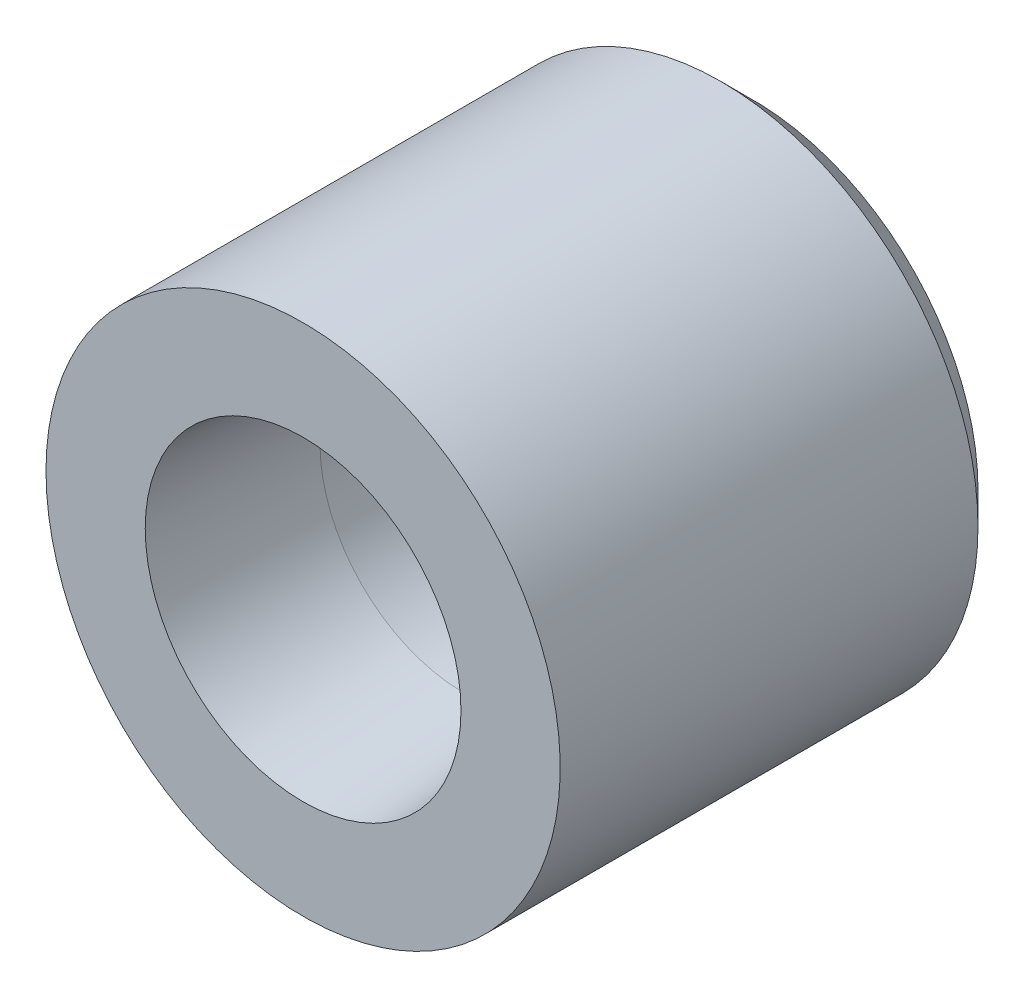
ISO-10303-21;
HEADER;
FILE_DESCRIPTION(('STEP AP214'),'2;1');
FILE_NAME('part.step','',(''),(''),'','','');
FILE_SCHEMA(('AUTOMOTIVE_DESIGN { 1 0 10303 214 1 1 1 1 }'));
ENDSEC;
DATA;
#1=APPLICATION_CONTEXT('core data for automotive mechanical design processes');
#2=APPLICATION_PROTOCOL_DEFINITION('international standard','automotive_design',2000,#1);
#3=PRODUCT_CONTEXT('',#1,'mechanical');
#4=PRODUCT('Part','Part','',(#3));
#5=PRODUCT_RELATED_PRODUCT_CATEGORY('part','',(#4));
#6=PRODUCT_DEFINITION_FORMATION('','',#4);
#7=PRODUCT_DEFINITION_CONTEXT('part definition',#1,'design');
#8=PRODUCT_DEFINITION('design','',#6,#7);
#9=PRODUCT_DEFINITION_SHAPE('','',#8);
#10=(LENGTH_UNIT() NAMED_UNIT(*) SI_UNIT(.MILLI.,.METRE.));
#11=(NAMED_UNIT(*) PLANE_ANGLE_UNIT() SI_UNIT($,.RADIAN.));
#12=(NAMED_UNIT(*) SI_UNIT($,.STERADIAN.) SOLID_ANGLE_UNIT());
#13=UNCERTAINTY_MEASURE_WITH_UNIT(LENGTH_MEASURE(1.E-05),#10,'distance_accuracy_value','');
#14=(GEOMETRIC_REPRESENTATION_CONTEXT(3) GLOBAL_UNCERTAINTY_ASSIGNED_CONTEXT((#13)) GLOBAL_UNIT_ASSIGNED_CONTEXT((#10,
#11,#12)) REPRESENTATION_CONTEXT('',''));
#15=CARTESIAN_POINT('',(0.,0.,0.));
#16=DIRECTION('',(0.,0.,1.));
#17=DIRECTION('',(1.,0.,0.));
#18=AXIS2_PLACEMENT_3D('',#15,#16,#17);
#19=CARTESIAN_POINT('',(0.,0.,-6.14636613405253));
#20=DIRECTION('',(0.,0.,1.));
#21=DIRECTION('',(1.,0.,0.));
#22=AXIS2_PLACEMENT_3D('',#19,#20,#21);
#23=CONICAL_SURFACE('',#22,6.32870188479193,0.785398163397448);
#24=CARTESIAN_POINT('',(0.,0.,-9.));
#25=DIRECTION('',(0.,0.,1.));
#26=DIRECTION('',(-1.,0.,0.));
#27=AXIS2_PLACEMENT_3D('',#24,#25,#26);
#28=CIRCLE('',#27,3.47506801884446);
#29=CARTESIAN_POINT('',(3.47506801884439,0.,-9.));
#30=VERTEX_POINT('',#29);
#31=CARTESIAN_POINT('',(-3.47506801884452,0.,-9.));
#32=VERTEX_POINT('',#31);
#33=EDGE_CURVE('E142',#30,#32,#28,.T.);
#34=ORIENTED_EDGE('',*,*,#33,.F.);
#35=CARTESIAN_POINT('',(3.47506858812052,0.,-8.9999994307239));
#36=CARTESIAN_POINT('',(4.47506869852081,0.,-7.99999932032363));
#37=B_SPLINE_CURVE_WITH_KNOTS('',1,(#35,#36),.UNSPECIFIED.,.F.,.F.,(2,2),(0.549096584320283,
0.707106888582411),.UNSPECIFIED.);
#38=CARTESIAN_POINT('',(4.4750680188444,0.,-8.));
#39=VERTEX_POINT('',#38);
#40=EDGE_CURVE('E44',#30,#39,#37,.T.);
#41=ORIENTED_EDGE('',*,*,#40,.T.);
#42=CARTESIAN_POINT('',(0.,0.,-8.));
#43=DIRECTION('',(0.,0.,-1.));
#44=DIRECTION('',(-1.,0.,0.));
#45=AXIS2_PLACEMENT_3D('',#42,#43,#44);
#46=CIRCLE('',#45,4.47506801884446);
#47=CARTESIAN_POINT('',(-4.47506801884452,0.,-8.));
#48=VERTEX_POINT('',#47);
#49=EDGE_CURVE('E11',#48,#39,#46,.T.);
#50=ORIENTED_EDGE('',*,*,#49,.F.);
#51=CARTESIAN_POINT('',(0.,0.,-8.));
#52=DIRECTION('',(0.,0.,-1.));
#53=DIRECTION('',(-1.,0.,0.));
#54=AXIS2_PLACEMENT_3D('',#51,#52,#53);
#55=CIRCLE('',#54,4.47506801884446);
#56=EDGE_CURVE('E51',#39,#48,#55,.T.);
#57=ORIENTED_EDGE('',*,*,#56,.F.);
#58=ORIENTED_EDGE('',*,*,#40,.F.);
#59=CARTESIAN_POINT('',(0.,0.,-9.));
#60=DIRECTION('',(0.,0.,1.));
#61=DIRECTION('',(-1.,0.,0.));
#62=AXIS2_PLACEMENT_3D('',#59,#60,#61);
#63=CIRCLE('',#62,3.47506801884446);
#64=EDGE_CURVE('E59',#32,#30,#63,.T.);
#65=ORIENTED_EDGE('',*,*,#64,.F.);
#66=EDGE_LOOP('',(#34,#41,#50,#57,#58,#65));
#67=FACE_BOUND('',#66,.T.);
#68=ADVANCED_FACE('F36',(#67),#23,.F.);
#69=CARTESIAN_POINT('',(0.,0.,-7.5));
#70=DIRECTION('',(0.,0.,-1.));
#71=DIRECTION('',(-1.,0.,0.));
#72=AXIS2_PLACEMENT_3D('',#69,#70,#71);
#73=CYLINDRICAL_SURFACE('',#72,4.47506801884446);
#74=CARTESIAN_POINT('',(0.,0.,-6.));
#75=DIRECTION('',(0.,0.,-1.));
#76=DIRECTION('',(-1.,0.,0.));
#77=AXIS2_PLACEMENT_3D('',#74,#75,#76);
#78=CIRCLE('',#77,4.47506801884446);
#79=CARTESIAN_POINT('',(-4.4750680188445,0.,-6.));
#80=VERTEX_POINT('',#79);
#81=EDGE_CURVE('E151',#80,#80,#78,.T.);
#82=ORIENTED_EDGE('',*,*,#81,.F.);
#83=CARTESIAN_POINT('',(-4.4750680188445,0.,-5.99999694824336));
#84=CARTESIAN_POINT('',(-4.47506801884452,0.,-8.00000201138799));
#85=B_SPLINE_CURVE_WITH_KNOTS('',1,(#83,#84),.UNSPECIFIED.,.F.,.F.,(2,2),(0.0833320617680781,
0.91666750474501),.UNSPECIFIED.);
#86=EDGE_CURVE('E146',#80,#48,#85,.T.);
#87=ORIENTED_EDGE('',*,*,#86,.T.);
#88=ORIENTED_EDGE('',*,*,#49,.T.);
#89=ORIENTED_EDGE('',*,*,#56,.T.);
#90=ORIENTED_EDGE('',*,*,#86,.F.);
#91=EDGE_LOOP('',(#82,#87,#88,#89,#90));
#92=FACE_BOUND('',#91,.T.);
#93=ADVANCED_FACE('F192',(#92),#73,.F.);
#94=CARTESIAN_POINT('',(7.99265644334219,-7.22279324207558,-9.));
#95=DIRECTION('',(0.,0.,-1.));
#96=DIRECTION('',(-1.,0.,0.));
#97=AXIS2_PLACEMENT_3D('',#94,#95,#96);
#98=PLANE('',#97);
#99=CARTESIAN_POINT('',(-1.04744440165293E-13,0.,-8.99999999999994));
#100=DIRECTION('',(0.,0.,-1.));
#101=DIRECTION('',(-1.,0.,0.));
#102=AXIS2_PLACEMENT_3D('',#99,#100,#101);
#103=CIRCLE('',#102,2.09999999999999);
#104=CARTESIAN_POINT('',(-2.1000000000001,0.,-8.99999999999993));
#105=VERTEX_POINT('',#104);
#106=EDGE_CURVE('E39',#105,#105,#103,.T.);
#107=ORIENTED_EDGE('',*,*,#106,.T.);
#108=EDGE_LOOP('',(#107));
#109=FACE_BOUND('',#108,.T.);
#110=ORIENTED_EDGE('',*,*,#64,.T.);
#111=ORIENTED_EDGE('',*,*,#33,.T.);
#112=EDGE_LOOP('',(#110,#111));
#113=FACE_BOUND('',#112,.T.);
#114=ADVANCED_FACE('F194',(#109,#113),#98,.F.);
#115=CARTESIAN_POINT('',(0.,0.,-1.));
#116=DIRECTION('',(0.,0.,1.));
#117=DIRECTION('',(-1.,0.,0.));
#118=AXIS2_PLACEMENT_3D('',#115,#116,#117);
#119=CONICAL_SURFACE('',#118,4.91251133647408,0.0872664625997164);
#120=ORIENTED_EDGE('',*,*,#81,.T.);
#121=CARTESIAN_POINT('',(-4.4750680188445,0.,-6.));
#122=CARTESIAN_POINT('',(-4.91251133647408,0.,-0.999999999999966));
#123=B_SPLINE_CURVE_WITH_KNOTS('',1,(#121,#122),.UNSPECIFIED.,.F.,.F.,(2,2),(0.,1.),.UNSPECIFIED.);
#124=CARTESIAN_POINT('',(-4.91251133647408,0.,-0.999999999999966));
#125=VERTEX_POINT('',#124);
#126=EDGE_CURVE('E107',#80,#125,#123,.T.);
#127=ORIENTED_EDGE('',*,*,#126,.T.);
#128=CARTESIAN_POINT('',(0.,0.,-1.));
#129=DIRECTION('',(0.,0.,-1.));
#130=DIRECTION('',(1.,0.,0.));
#131=AXIS2_PLACEMENT_3D('',#128,#129,#130);
#132=CIRCLE('',#131,4.91251133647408);
#133=CARTESIAN_POINT('',(4.91251133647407,0.,-1.00000000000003));
#134=VERTEX_POINT('',#133);
#135=EDGE_CURVE('E132',#134,#125,#132,.T.);
#136=ORIENTED_EDGE('',*,*,#135,.F.);
#137=CARTESIAN_POINT('',(0.,0.,-1.));
#138=DIRECTION('',(0.,0.,-1.));
#139=DIRECTION('',(1.,0.,0.));
#140=AXIS2_PLACEMENT_3D('',#137,#138,#139);
#141=CIRCLE('',#140,4.91251133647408);
#142=EDGE_CURVE('E125',#125,#134,#141,.T.);
#143=ORIENTED_EDGE('',*,*,#142,.F.);
#144=ORIENTED_EDGE('',*,*,#126,.F.);
#145=EDGE_LOOP('',(#120,#127,#136,#143,#144));
#146=FACE_BOUND('',#145,.T.);
#147=ADVANCED_FACE('F190',(#146),#119,.F.);
#148=CARTESIAN_POINT('',(0.,0.,-10.6862915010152));
#149=DIRECTION('',(0.,0.,1.));
#150=DIRECTION('',(1.,0.,0.));
#151=AXIS2_PLACEMENT_3D('',#148,#149,#150);
#152=CONICAL_SURFACE('',#151,11.3137084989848,0.785398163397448);
#153=CARTESIAN_POINT('',(-1.04744440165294E-13,0.,-15.));
#154=DIRECTION('',(0.,0.,1.));
#155=DIRECTION('',(-1.,0.,0.));
#156=AXIS2_PLACEMENT_3D('',#153,#154,#155);
#157=CIRCLE('',#156,7.);
#158=CARTESIAN_POINT('',(-7.00000000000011,0.,-15.));
#159=VERTEX_POINT('',#158);
#160=CARTESIAN_POINT('',(6.9999999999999,0.,-15.));
#161=VERTEX_POINT('',#160);
#162=EDGE_CURVE('E90',#159,#161,#157,.T.);
#163=ORIENTED_EDGE('',*,*,#162,.T.);
#164=CARTESIAN_POINT('',(7.00000107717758,0.,-14.9999989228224));
#165=CARTESIAN_POINT('',(7.9999983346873,0.,-14.0000016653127));
#166=B_SPLINE_CURVE_WITH_KNOTS('',1,(#164,#165),.UNSPECIFIED.,.F.,.F.,(2,2),(0.618718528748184,
0.707106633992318),.UNSPECIFIED.);
#167=CARTESIAN_POINT('',(7.9999999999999,0.,-14.));
#168=VERTEX_POINT('',#167);
#169=EDGE_CURVE('E95',#161,#168,#166,.T.);
#170=ORIENTED_EDGE('',*,*,#169,.T.);
#171=CARTESIAN_POINT('',(0.,0.,-14.));
#172=DIRECTION('',(0.,0.,-1.));
#173=DIRECTION('',(-1.,0.,0.));
#174=AXIS2_PLACEMENT_3D('',#171,#172,#173);
#175=CIRCLE('',#174,8.);
#176=CARTESIAN_POINT('',(-8.0000000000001,0.,-14.));
#177=VERTEX_POINT('',#176);
#178=EDGE_CURVE('E102',#168,#177,#175,.T.);
#179=ORIENTED_EDGE('',*,*,#178,.T.);
#180=CARTESIAN_POINT('',(0.,0.,-14.));
#181=DIRECTION('',(0.,0.,-1.));
#182=DIRECTION('',(-1.,0.,0.));
#183=AXIS2_PLACEMENT_3D('',#180,#181,#182);
#184=CIRCLE('',#183,8.);
#185=EDGE_CURVE('E104',#177,#168,#184,.T.);
#186=ORIENTED_EDGE('',*,*,#185,.T.);
#187=ORIENTED_EDGE('',*,*,#169,.F.);
#188=CARTESIAN_POINT('',(-1.04744440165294E-13,0.,-15.));
#189=DIRECTION('',(0.,0.,1.));
#190=DIRECTION('',(-1.,0.,0.));
#191=AXIS2_PLACEMENT_3D('',#188,#189,#190);
#192=CIRCLE('',#191,7.);
#193=EDGE_CURVE('E97',#161,#159,#192,.T.);
#194=ORIENTED_EDGE('',*,*,#193,.T.);
#195=EDGE_LOOP('',(#163,#170,#179,#186,#187,#194));
#196=FACE_BOUND('',#195,.T.);
#197=ADVANCED_FACE('F92',(#196),#152,.T.);
#198=CARTESIAN_POINT('',(0.,0.,-8.));
#199=DIRECTION('',(0.,0.,-1.));
#200=DIRECTION('',(-1.,0.,0.));
#201=AXIS2_PLACEMENT_3D('',#198,#199,#200);
#202=CYLINDRICAL_SURFACE('',#201,8.);
#203=CARTESIAN_POINT('',(0.,0.,-1.));
#204=DIRECTION('',(0.,0.,1.));
#205=DIRECTION('',(-1.,0.,0.));
#206=AXIS2_PLACEMENT_3D('',#203,#204,#205);
#207=CIRCLE('',#206,8.);
#208=CARTESIAN_POINT('',(-8.,0.,-0.999999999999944));
#209=VERTEX_POINT('',#208);
#210=EDGE_CURVE('E99',#209,#209,#207,.T.);
#211=ORIENTED_EDGE('',*,*,#210,.F.);
#212=CARTESIAN_POINT('',(-8.,0.,-1.00000099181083));
#213=CARTESIAN_POINT('',(-8.0000000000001,0.,-14.0000013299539));
#214=B_SPLINE_CURVE_WITH_KNOTS('',1,(#212,#213),.UNSPECIFIED.,.F.,.F.,(2,2),(0.0833333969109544,
0.916666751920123),.UNSPECIFIED.);
#215=EDGE_CURVE('E172',#209,#177,#214,.T.);
#216=ORIENTED_EDGE('',*,*,#215,.T.);
#217=ORIENTED_EDGE('',*,*,#178,.F.);
#218=ORIENTED_EDGE('',*,*,#185,.F.);
#219=ORIENTED_EDGE('',*,*,#215,.F.);
#220=EDGE_LOOP('',(#211,#216,#217,#218,#219));
#221=FACE_BOUND('',#220,.T.);
#222=ADVANCED_FACE('F226',(#221),#202,.T.);
#223=CARTESIAN_POINT('',(16.1,-14.5492267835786,-15.));
#224=DIRECTION('',(0.,0.,-1.));
#225=DIRECTION('',(-1.,0.,0.));
#226=AXIS2_PLACEMENT_3D('',#223,#224,#225);
#227=PLANE('',#226);
#228=CARTESIAN_POINT('',(-1.04744440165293E-13,0.,-14.9999999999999));
#229=DIRECTION('',(0.,0.,-1.));
#230=DIRECTION('',(-1.,0.,0.));
#231=AXIS2_PLACEMENT_3D('',#228,#229,#230);
#232=CIRCLE('',#231,2.09999999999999);
#233=CARTESIAN_POINT('',(-2.10000000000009,0.,-14.9999999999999));
#234=VERTEX_POINT('',#233);
#235=EDGE_CURVE('E276',#234,#234,#232,.T.);
#236=ORIENTED_EDGE('',*,*,#235,.F.);
#237=EDGE_LOOP('',(#236));
#238=FACE_BOUND('',#237,.T.);
#239=ORIENTED_EDGE('',*,*,#193,.F.);
#240=ORIENTED_EDGE('',*,*,#162,.F.);
#241=EDGE_LOOP('',(#239,#240));
#242=FACE_BOUND('',#241,.T.);
#243=ADVANCED_FACE('F101',(#238,#242),#227,.T.);
#244=CARTESIAN_POINT('',(-10.4,-16.6276877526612,-0.999999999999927));
#245=DIRECTION('',(0.,0.,1.));
#246=DIRECTION('',(1.,0.,0.));
#247=AXIS2_PLACEMENT_3D('',#244,#245,#246);
#248=PLANE('',#247);
#249=ORIENTED_EDGE('',*,*,#210,.T.);
#250=EDGE_LOOP('',(#249));
#251=FACE_BOUND('',#250,.T.);
#252=ORIENTED_EDGE('',*,*,#135,.T.);
#253=ORIENTED_EDGE('',*,*,#142,.T.);
#254=EDGE_LOOP('',(#252,#253));
#255=FACE_BOUND('',#254,.T.);
#256=ADVANCED_FACE('F241',(#251,#255),#248,.T.);
#257=CARTESIAN_POINT('',(-1.04744440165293E-13,0.,-14.9999999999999));
#258=DIRECTION('',(0.,0.,-1.));
#259=DIRECTION('',(-1.,0.,0.));
#260=AXIS2_PLACEMENT_3D('',#257,#258,#259);
#261=CYLINDRICAL_SURFACE('',#260,2.09999999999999);
#262=ORIENTED_EDGE('',*,*,#235,.T.);
#263=EDGE_LOOP('',(#262));
#264=FACE_BOUND('',#263,.T.);
#265=ORIENTED_EDGE('',*,*,#106,.F.);
#266=EDGE_LOOP('',(#265));
#267=FACE_BOUND('',#266,.T.);
#268=ADVANCED_FACE('F249',(#264,#267),#261,.F.);
#269=CLOSED_SHELL('',(#68,#93,#114,#147,#197,#222,#243,#256,#268));
#270=MANIFOLD_SOLID_BREP('B2',#269);
#271=ADVANCED_BREP_SHAPE_REPRESENTATION('',(#18,#270),#14);
#272=SHAPE_DEFINITION_REPRESENTATION(#9,#271);
ENDSEC;
END-ISO-10303-21;
